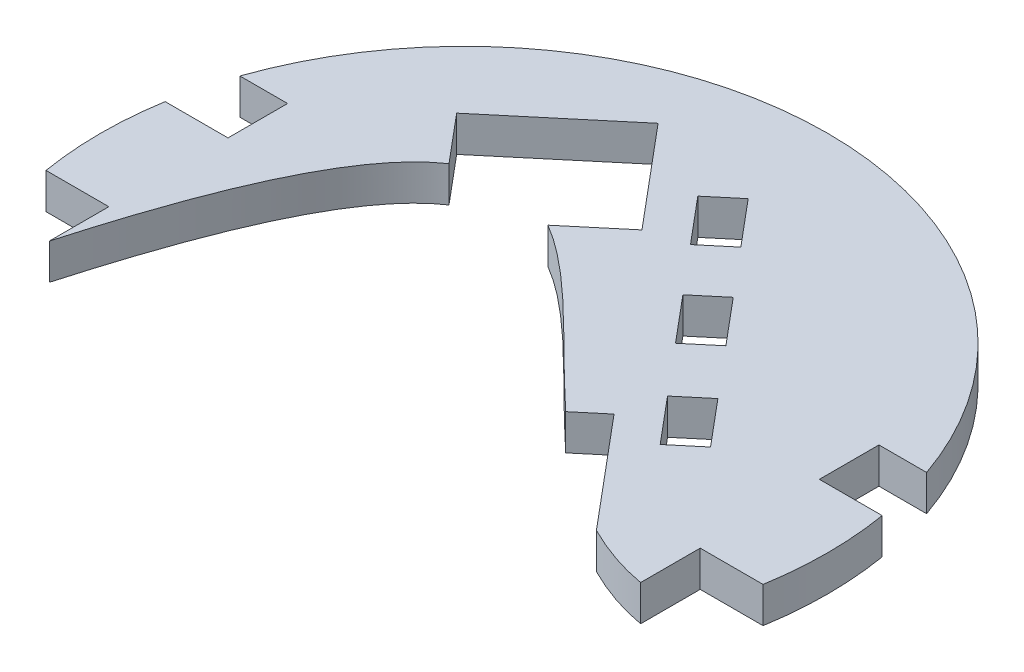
ISO-10303-21;
HEADER;
FILE_DESCRIPTION(('STEP AP214'),'2;1');
FILE_NAME('part.step','',(''),(''),'','','');
FILE_SCHEMA(('AUTOMOTIVE_DESIGN { 1 0 10303 214 1 1 1 1 }'));
ENDSEC;
DATA;
#1=APPLICATION_CONTEXT('core data for automotive mechanical design processes');
#2=APPLICATION_PROTOCOL_DEFINITION('international standard','automotive_design',2000,#1);
#3=PRODUCT_CONTEXT('',#1,'mechanical');
#4=PRODUCT('Part','Part','',(#3));
#5=PRODUCT_RELATED_PRODUCT_CATEGORY('part','',(#4));
#6=PRODUCT_DEFINITION_FORMATION('','',#4);
#7=PRODUCT_DEFINITION_CONTEXT('part definition',#1,'design');
#8=PRODUCT_DEFINITION('design','',#6,#7);
#9=PRODUCT_DEFINITION_SHAPE('','',#8);
#10=(LENGTH_UNIT() NAMED_UNIT(*) SI_UNIT(.MILLI.,.METRE.));
#11=(NAMED_UNIT(*) PLANE_ANGLE_UNIT() SI_UNIT($,.RADIAN.));
#12=(NAMED_UNIT(*) SI_UNIT($,.STERADIAN.) SOLID_ANGLE_UNIT());
#13=UNCERTAINTY_MEASURE_WITH_UNIT(LENGTH_MEASURE(1.E-05),#10,'distance_accuracy_value','');
#14=(GEOMETRIC_REPRESENTATION_CONTEXT(3) GLOBAL_UNCERTAINTY_ASSIGNED_CONTEXT((#13)) GLOBAL_UNIT_ASSIGNED_CONTEXT((#10,
#11,#12)) REPRESENTATION_CONTEXT('',''));
#15=CARTESIAN_POINT('',(0.,0.,0.));
#16=DIRECTION('',(0.,0.,1.));
#17=DIRECTION('',(1.,0.,0.));
#18=AXIS2_PLACEMENT_3D('',#15,#16,#17);
#19=CARTESIAN_POINT('',(0.,3.,0.));
#20=DIRECTION('',(0.,1.,0.));
#21=DIRECTION('',(0.,0.,1.));
#22=AXIS2_PLACEMENT_3D('',#19,#20,#21);
#23=PLANE('',#22);
#24=DIRECTION('',(0.64278760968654,0.,0.766044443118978));
#25=VECTOR('',#24,1.);
#26=CARTESIAN_POINT('',(11.8736888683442,3.,-9.96320795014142));
#27=LINE('',#26,#25);
#28=CARTESIAN_POINT('',(14.6858846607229,3.,-6.61176351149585));
#29=VERTEX_POINT('',#28);
#30=CARTESIAN_POINT('',(17.8998227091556,3.,-2.78154129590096));
#31=VERTEX_POINT('',#30);
#32=EDGE_CURVE('E721',#29,#31,#27,.T.);
#33=ORIENTED_EDGE('',*,*,#32,.T.);
#34=DIRECTION('',(-0.766044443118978,0.,0.64278760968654));
#35=VECTOR('',#34,1.);
#36=CARTESIAN_POINT('',(6.02613384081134,3.,7.18166665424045));
#37=LINE('',#36,#35);
#38=CARTESIAN_POINT('',(15.6016893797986,3.,-0.853178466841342));
#39=VERTEX_POINT('',#38);
#40=EDGE_CURVE('E724',#31,#39,#37,.T.);
#41=ORIENTED_EDGE('',*,*,#40,.T.);
#42=DIRECTION('',(0.64278760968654,0.,0.766044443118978));
#43=VECTOR('',#42,1.);
#44=CARTESIAN_POINT('',(9.57555553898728,3.,-8.0348451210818));
#45=LINE('',#44,#43);
#46=CARTESIAN_POINT('',(12.3877513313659,3.,-4.68340068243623));
#47=VERTEX_POINT('',#46);
#48=EDGE_CURVE('E711',#47,#39,#45,.T.);
#49=ORIENTED_EDGE('',*,*,#48,.F.);
#50=DIRECTION('',(-0.766044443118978,0.,0.64278760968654));
#51=VECTOR('',#50,1.);
#52=CARTESIAN_POINT('',(2.81219579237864,3.,3.35144443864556));
#53=LINE('',#52,#51);
#54=EDGE_CURVE('E718',#29,#47,#53,.T.);
#55=ORIENTED_EDGE('',*,*,#54,.F.);
#56=EDGE_LOOP('',(#33,#41,#49,#55));
#57=FACE_BOUND('',#56,.T.);
#58=DIRECTION('',(0.64278760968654,0.,0.766044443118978));
#59=VECTOR('',#58,1.);
#60=CARTESIAN_POINT('',(11.8736888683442,3.,-9.96320795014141));
#61=LINE('',#60,#59);
#62=CARTESIAN_POINT('',(1.42839021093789,3.,-22.4114301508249));
#63=VERTEX_POINT('',#62);
#64=CARTESIAN_POINT('',(4.64232825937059,3.,-18.58120793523));
#65=VERTEX_POINT('',#64);
#66=EDGE_CURVE('E700',#63,#65,#61,.T.);
#67=ORIENTED_EDGE('',*,*,#66,.T.);
#68=DIRECTION('',(-0.766044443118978,0.,0.64278760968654));
#69=VECTOR('',#68,1.);
#70=CARTESIAN_POINT('',(-7.23136060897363,3.,-8.61799998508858));
#71=LINE('',#70,#69);
#72=CARTESIAN_POINT('',(2.34419493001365,3.,-16.6528451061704));
#73=VERTEX_POINT('',#72);
#74=EDGE_CURVE('E703',#65,#73,#71,.T.);
#75=ORIENTED_EDGE('',*,*,#74,.T.);
#76=DIRECTION('',(0.64278760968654,0.,0.766044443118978));
#77=VECTOR('',#76,1.);
#78=CARTESIAN_POINT('',(9.57555553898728,3.,-8.0348451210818));
#79=LINE('',#78,#77);
#80=CARTESIAN_POINT('',(-0.869743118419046,3.,-20.4830673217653));
#81=VERTEX_POINT('',#80);
#82=EDGE_CURVE('E690',#81,#73,#79,.T.);
#83=ORIENTED_EDGE('',*,*,#82,.F.);
#84=DIRECTION('',(-0.766044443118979,0.,0.642787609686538));
#85=VECTOR('',#84,1.);
#86=CARTESIAN_POINT('',(-10.4452986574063,3.,-12.4482222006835));
#87=LINE('',#86,#85);
#88=EDGE_CURVE('E697',#63,#81,#87,.T.);
#89=ORIENTED_EDGE('',*,*,#88,.F.);
#90=EDGE_LOOP('',(#67,#75,#83,#89));
#91=FACE_BOUND('',#90,.T.);
#92=CARTESIAN_POINT('',(24.8140590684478,3.,10.));
#93=CARTESIAN_POINT('',(2.6081002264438,3.,6.09954088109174));
#94=CARTESIAN_POINT('',(-10.3265066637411,3.,-41.1093024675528));
#95=CARTESIAN_POINT('',(-24.8140590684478,3.,10.));
#96=B_SPLINE_CURVE_WITH_KNOTS('',3,(#92,#93,#94,#95),.UNSPECIFIED.,.F.,.F.,(4,4),(0.,1.),.UNSPECIFIED.);
#97=CARTESIAN_POINT('',(-13.6660144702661,3.,-12.3972122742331));
#98=VERTEX_POINT('',#97);
#99=CARTESIAN_POINT('',(-24.8140590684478,3.,10.));
#100=VERTEX_POINT('',#99);
#101=EDGE_CURVE('E405',#98,#100,#96,.T.);
#102=ORIENTED_EDGE('',*,*,#101,.F.);
#103=DIRECTION('',(-0.64278760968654,0.,-0.766044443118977));
#104=VECTOR('',#103,1.);
#105=CARTESIAN_POINT('',(-1.91511110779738,3.,1.6069690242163));
#106=LINE('',#105,#104);
#107=CARTESIAN_POINT('',(-17.0206199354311,3.,-16.3950753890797));
#108=VERTEX_POINT('',#107);
#109=EDGE_CURVE('E750',#98,#108,#106,.T.);
#110=ORIENTED_EDGE('',*,*,#109,.T.);
#111=DIRECTION('',(-0.766044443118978,0.,0.64278760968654));
#112=VECTOR('',#111,1.);
#113=CARTESIAN_POINT('',(-15.1055088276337,3.,-18.002044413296));
#114=LINE('',#113,#112);
#115=CARTESIAN_POINT('',(-7.82808661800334,3.,-24.1085267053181));
#116=VERTEX_POINT('',#115);
#117=EDGE_CURVE('E765',#116,#108,#114,.T.);
#118=ORIENTED_EDGE('',*,*,#117,.F.);
#119=DIRECTION('',(0.642787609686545,0.,0.766044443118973));
#120=VECTOR('',#119,1.);
#121=CARTESIAN_POINT('',(7.27742220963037,3.,-6.10648229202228));
#122=LINE('',#121,#120);
#123=CARTESIAN_POINT('',(-0.757422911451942,3.,-15.6820378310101));
#124=VERTEX_POINT('',#123);
#125=EDGE_CURVE('E768',#116,#124,#122,.T.);
#126=ORIENTED_EDGE('',*,*,#125,.T.);
#127=DIRECTION('',(-0.766044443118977,0.,0.64278760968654));
#128=VECTOR('',#127,1.);
#129=CARTESIAN_POINT('',(-8.0348451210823,3.,-9.57555553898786));
#130=LINE('',#129,#128);
#131=CARTESIAN_POINT('',(-5.04935939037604,3.,-12.0806755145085));
#132=VERTEX_POINT('',#131);
#133=EDGE_CURVE('E771',#124,#132,#130,.T.);
#134=ORIENTED_EDGE('',*,*,#133,.T.);
#135=CARTESIAN_POINT('',(9.24867851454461,3.,0.724584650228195));
#136=VERTEX_POINT('',#135);
#137=EDGE_CURVE('E774',#136,#132,#96,.T.);
#138=ORIENTED_EDGE('',*,*,#137,.F.);
#139=DIRECTION('',(-0.766044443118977,0.,0.64278760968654));
#140=VECTOR('',#139,1.);
#141=CARTESIAN_POINT('',(4.17811946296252,3.,4.97928888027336));
#142=LINE('',#141,#140);
#143=CARTESIAN_POINT('',(11.4555416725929,3.,-1.12719341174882));
#144=VERTEX_POINT('',#143);
#145=EDGE_CURVE('E775',#144,#136,#142,.T.);
#146=ORIENTED_EDGE('',*,*,#145,.F.);
#147=DIRECTION('',(0.64278760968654,0.,0.766044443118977));
#148=VECTOR('',#147,1.);
#149=CARTESIAN_POINT('',(7.27742220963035,3.,-6.10648229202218));
#150=LINE('',#149,#148);
#151=CARTESIAN_POINT('',(19.1689929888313,3.,8.0653399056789));
#152=VERTEX_POINT('',#151);
#153=EDGE_CURVE('E777',#144,#152,#150,.T.);
#154=ORIENTED_EDGE('',*,*,#153,.T.);
#155=CARTESIAN_POINT('',(24.8140590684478,3.,10.));
#156=VERTEX_POINT('',#155);
#157=EDGE_CURVE('E779',#156,#152,#96,.T.);
#158=ORIENTED_EDGE('',*,*,#157,.F.);
#159=DIRECTION('',(0.,0.,1.));
#160=VECTOR('',#159,1.);
#161=CARTESIAN_POINT('',(24.8140590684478,3.,0.));
#162=LINE('',#161,#160);
#163=CARTESIAN_POINT('',(24.8140590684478,3.,5.));
#164=VERTEX_POINT('',#163);
#165=EDGE_CURVE('E682',#164,#156,#162,.T.);
#166=ORIENTED_EDGE('',*,*,#165,.F.);
#167=DIRECTION('',(1.,0.,0.));
#168=VECTOR('',#167,1.);
#169=CARTESIAN_POINT('',(0.,3.,5.));
#170=LINE('',#169,#168);
#171=CARTESIAN_POINT('',(30.0873727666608,3.,5.));
#172=VERTEX_POINT('',#171);
#173=EDGE_CURVE('E571',#164,#172,#170,.T.);
#174=ORIENTED_EDGE('',*,*,#173,.T.);
#175=CARTESIAN_POINT('',(0.,3.,0.));
#176=DIRECTION('',(0.,1.,0.));
#177=DIRECTION('',(0.,0.,1.));
#178=AXIS2_PLACEMENT_3D('',#175,#176,#177);
#179=CIRCLE('',#178,30.5);
#180=CARTESIAN_POINT('',(30.0873727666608,3.,-5.));
#181=VERTEX_POINT('',#180);
#182=EDGE_CURVE('E551',#172,#181,#179,.T.);
#183=ORIENTED_EDGE('',*,*,#182,.T.);
#184=DIRECTION('',(1.,0.,0.));
#185=VECTOR('',#184,1.);
#186=CARTESIAN_POINT('',(0.,3.,-5.00000000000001));
#187=LINE('',#186,#185);
#188=CARTESIAN_POINT('',(24.8140590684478,3.,-5.));
#189=VERTEX_POINT('',#188);
#190=EDGE_CURVE('E667',#189,#181,#187,.T.);
#191=ORIENTED_EDGE('',*,*,#190,.F.);
#192=DIRECTION('',(0.,0.,-1.));
#193=VECTOR('',#192,1.);
#194=CARTESIAN_POINT('',(24.8140590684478,3.,0.));
#195=LINE('',#194,#193);
#196=CARTESIAN_POINT('',(24.8140590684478,3.,-10.));
#197=VERTEX_POINT('',#196);
#198=EDGE_CURVE('E671',#189,#197,#195,.T.);
#199=ORIENTED_EDGE('',*,*,#198,.T.);
#200=DIRECTION('',(1.,0.,0.));
#201=VECTOR('',#200,1.);
#202=CARTESIAN_POINT('',(0.,3.,-10.));
#203=LINE('',#202,#201);
#204=CARTESIAN_POINT('',(28.8140590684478,3.,-10.));
#205=VERTEX_POINT('',#204);
#206=EDGE_CURVE('E674',#197,#205,#203,.T.);
#207=ORIENTED_EDGE('',*,*,#206,.T.);
#208=CARTESIAN_POINT('',(-28.8140590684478,3.,-10.));
#209=VERTEX_POINT('',#208);
#210=EDGE_CURVE('E631',#205,#209,#179,.T.);
#211=ORIENTED_EDGE('',*,*,#210,.T.);
#212=DIRECTION('',(-1.,0.,0.));
#213=VECTOR('',#212,1.);
#214=CARTESIAN_POINT('',(0.,3.,-10.));
#215=LINE('',#214,#213);
#216=CARTESIAN_POINT('',(-24.8140590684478,3.,-10.));
#217=VERTEX_POINT('',#216);
#218=EDGE_CURVE('E645',#217,#209,#215,.T.);
#219=ORIENTED_EDGE('',*,*,#218,.F.);
#220=DIRECTION('',(0.,0.,-1.));
#221=VECTOR('',#220,1.);
#222=CARTESIAN_POINT('',(-24.8140590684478,3.,0.));
#223=LINE('',#222,#221);
#224=CARTESIAN_POINT('',(-24.8140590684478,3.,-5.));
#225=VERTEX_POINT('',#224);
#226=EDGE_CURVE('E653',#225,#217,#223,.T.);
#227=ORIENTED_EDGE('',*,*,#226,.F.);
#228=DIRECTION('',(-1.,0.,0.));
#229=VECTOR('',#228,1.);
#230=CARTESIAN_POINT('',(0.,3.,-5.));
#231=LINE('',#230,#229);
#232=CARTESIAN_POINT('',(-30.0873727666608,3.,-5.));
#233=VERTEX_POINT('',#232);
#234=EDGE_CURVE('E656',#225,#233,#231,.T.);
#235=ORIENTED_EDGE('',*,*,#234,.T.);
#236=CARTESIAN_POINT('',(-30.0873727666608,3.,5.));
#237=VERTEX_POINT('',#236);
#238=EDGE_CURVE('E627',#233,#237,#179,.T.);
#239=ORIENTED_EDGE('',*,*,#238,.T.);
#240=DIRECTION('',(-1.,0.,0.));
#241=VECTOR('',#240,1.);
#242=CARTESIAN_POINT('',(0.,3.,5.00000000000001));
#243=LINE('',#242,#241);
#244=CARTESIAN_POINT('',(-24.8140590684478,3.,5.));
#245=VERTEX_POINT('',#244);
#246=EDGE_CURVE('E638',#245,#237,#243,.T.);
#247=ORIENTED_EDGE('',*,*,#246,.F.);
#248=DIRECTION('',(0.,0.,1.));
#249=VECTOR('',#248,1.);
#250=CARTESIAN_POINT('',(-24.8140590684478,3.,0.));
#251=LINE('',#250,#249);
#252=EDGE_CURVE('E634',#245,#100,#251,.T.);
#253=ORIENTED_EDGE('',*,*,#252,.T.);
#254=EDGE_LOOP('',(#102,#110,#118,#126,#134,#138,#146,#154,#158,#166,#174,#183,#191,#199,#207,
#211,#219,#227,#235,#239,#247,#253));
#255=FACE_BOUND('',#254,.T.);
#256=DIRECTION('',(-0.766044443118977,0.,0.642787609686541));
#257=VECTOR('',#256,1.);
#258=CARTESIAN_POINT('',(-3.90227068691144,3.,-4.65054511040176));
#259=LINE('',#258,#257);
#260=CARTESIAN_POINT('',(7.97141818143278,3.,-14.6137530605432));
#261=VERTEX_POINT('',#260);
#262=CARTESIAN_POINT('',(5.67328485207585,3.,-12.6853902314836));
#263=VERTEX_POINT('',#262);
#264=EDGE_CURVE('E393',#261,#263,#259,.T.);
#265=ORIENTED_EDGE('',*,*,#264,.F.);
#266=DIRECTION('',(0.642787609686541,0.,0.766044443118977));
#267=VECTOR('',#266,1.);
#268=CARTESIAN_POINT('',(11.8736888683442,3.,-9.96320795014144));
#269=LINE('',#268,#267);
#270=CARTESIAN_POINT('',(11.1853562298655,3.,-10.7835308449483));
#271=VERTEX_POINT('',#270);
#272=EDGE_CURVE('E176',#261,#271,#269,.T.);
#273=ORIENTED_EDGE('',*,*,#272,.T.);
#274=DIRECTION('',(-0.766044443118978,0.,0.64278760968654));
#275=VECTOR('',#274,1.);
#276=CARTESIAN_POINT('',(-0.688332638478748,3.,-0.820322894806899));
#277=LINE('',#276,#275);
#278=CARTESIAN_POINT('',(8.88722290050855,3.,-8.8551680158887));
#279=VERTEX_POINT('',#278);
#280=EDGE_CURVE('E398',#271,#279,#277,.T.);
#281=ORIENTED_EDGE('',*,*,#280,.T.);
#282=DIRECTION('',(0.64278760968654,0.,0.766044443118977));
#283=VECTOR('',#282,1.);
#284=CARTESIAN_POINT('',(9.57555553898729,3.,-8.03484512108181));
#285=LINE('',#284,#283);
#286=EDGE_CURVE('E384',#263,#279,#285,.T.);
#287=ORIENTED_EDGE('',*,*,#286,.F.);
#288=EDGE_LOOP('',(#265,#273,#281,#287));
#289=FACE_BOUND('',#288,.T.);
#290=ADVANCED_FACE('F161',(#57,#91,#255,#289),#23,.T.);
#291=CARTESIAN_POINT('',(0.,0.,0.));
#292=DIRECTION('',(0.,1.,0.));
#293=DIRECTION('',(0.,0.,1.));
#294=AXIS2_PLACEMENT_3D('',#291,#292,#293);
#295=PLANE('',#294);
#296=DIRECTION('',(-0.766044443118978,0.,0.64278760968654));
#297=VECTOR('',#296,1.);
#298=CARTESIAN_POINT('',(6.02613384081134,0.,7.18166665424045));
#299=LINE('',#298,#297);
#300=CARTESIAN_POINT('',(17.8998227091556,0.,-2.78154129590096));
#301=VERTEX_POINT('',#300);
#302=CARTESIAN_POINT('',(15.6016893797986,0.,-0.853178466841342));
#303=VERTEX_POINT('',#302);
#304=EDGE_CURVE('E524',#301,#303,#299,.T.);
#305=ORIENTED_EDGE('',*,*,#304,.F.);
#306=DIRECTION('',(0.64278760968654,0.,0.766044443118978));
#307=VECTOR('',#306,1.);
#308=CARTESIAN_POINT('',(11.8736888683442,0.,-9.96320795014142));
#309=LINE('',#308,#307);
#310=CARTESIAN_POINT('',(14.6858846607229,0.,-6.61176351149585));
#311=VERTEX_POINT('',#310);
#312=EDGE_CURVE('E598',#311,#301,#309,.T.);
#313=ORIENTED_EDGE('',*,*,#312,.F.);
#314=DIRECTION('',(-0.766044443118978,0.,0.64278760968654));
#315=VECTOR('',#314,1.);
#316=CARTESIAN_POINT('',(2.81219579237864,0.,3.35144443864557));
#317=LINE('',#316,#315);
#318=CARTESIAN_POINT('',(12.3877513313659,0.,-4.68340068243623));
#319=VERTEX_POINT('',#318);
#320=EDGE_CURVE('E595',#311,#319,#317,.T.);
#321=ORIENTED_EDGE('',*,*,#320,.T.);
#322=DIRECTION('',(0.64278760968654,0.,0.766044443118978));
#323=VECTOR('',#322,1.);
#324=CARTESIAN_POINT('',(9.57555553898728,0.,-8.0348451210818));
#325=LINE('',#324,#323);
#326=EDGE_CURVE('E593',#319,#303,#325,.T.);
#327=ORIENTED_EDGE('',*,*,#326,.T.);
#328=EDGE_LOOP('',(#305,#313,#321,#327));
#329=FACE_BOUND('',#328,.T.);
#330=DIRECTION('',(-0.64278760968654,0.,-0.766044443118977));
#331=VECTOR('',#330,1.);
#332=CARTESIAN_POINT('',(-1.91511110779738,0.,1.6069690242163));
#333=LINE('',#332,#331);
#334=CARTESIAN_POINT('',(-13.6660144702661,0.,-12.3972122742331));
#335=VERTEX_POINT('',#334);
#336=CARTESIAN_POINT('',(-17.0206199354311,0.,-16.3950753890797));
#337=VERTEX_POINT('',#336);
#338=EDGE_CURVE('E529',#335,#337,#333,.T.);
#339=ORIENTED_EDGE('',*,*,#338,.F.);
#340=CARTESIAN_POINT('',(24.8140590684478,0.,10.));
#341=CARTESIAN_POINT('',(2.6081002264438,0.,6.09954088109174));
#342=CARTESIAN_POINT('',(-10.3265066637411,0.,-41.1093024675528));
#343=CARTESIAN_POINT('',(-24.8140590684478,0.,10.));
#344=B_SPLINE_CURVE_WITH_KNOTS('',3,(#340,#341,#342,#343),.UNSPECIFIED.,.F.,.F.,(4,4),(0.,1.),.UNSPECIFIED.);
#345=CARTESIAN_POINT('',(-24.8140590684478,0.,10.));
#346=VERTEX_POINT('',#345);
#347=EDGE_CURVE('E727',#335,#346,#344,.T.);
#348=ORIENTED_EDGE('',*,*,#347,.T.);
#349=DIRECTION('',(0.,0.,1.));
#350=VECTOR('',#349,1.);
#351=CARTESIAN_POINT('',(-24.8140590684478,0.,0.));
#352=LINE('',#351,#350);
#353=CARTESIAN_POINT('',(-24.8140590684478,0.,5.));
#354=VERTEX_POINT('',#353);
#355=EDGE_CURVE('E547',#354,#346,#352,.T.);
#356=ORIENTED_EDGE('',*,*,#355,.F.);
#357=DIRECTION('',(-1.,0.,0.));
#358=VECTOR('',#357,1.);
#359=CARTESIAN_POINT('',(0.,0.,5.00000000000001));
#360=LINE('',#359,#358);
#361=CARTESIAN_POINT('',(-30.0873727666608,0.,5.));
#362=VERTEX_POINT('',#361);
#363=EDGE_CURVE('E550',#354,#362,#360,.T.);
#364=ORIENTED_EDGE('',*,*,#363,.T.);
#365=CARTESIAN_POINT('',(0.,0.,0.));
#366=DIRECTION('',(0.,1.,0.));
#367=DIRECTION('',(0.,0.,1.));
#368=AXIS2_PLACEMENT_3D('',#365,#366,#367);
#369=CIRCLE('',#368,30.5);
#370=CARTESIAN_POINT('',(-30.0873727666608,0.,-5.));
#371=VERTEX_POINT('',#370);
#372=EDGE_CURVE('E629',#371,#362,#369,.T.);
#373=ORIENTED_EDGE('',*,*,#372,.F.);
#374=DIRECTION('',(-1.,0.,0.));
#375=VECTOR('',#374,1.);
#376=CARTESIAN_POINT('',(0.,0.,-5.));
#377=LINE('',#376,#375);
#378=CARTESIAN_POINT('',(-24.8140590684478,0.,-5.));
#379=VERTEX_POINT('',#378);
#380=EDGE_CURVE('E615',#379,#371,#377,.T.);
#381=ORIENTED_EDGE('',*,*,#380,.F.);
#382=DIRECTION('',(0.,0.,-1.));
#383=VECTOR('',#382,1.);
#384=CARTESIAN_POINT('',(-24.8140590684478,0.,0.));
#385=LINE('',#384,#383);
#386=CARTESIAN_POINT('',(-24.8140590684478,0.,-10.));
#387=VERTEX_POINT('',#386);
#388=EDGE_CURVE('E620',#379,#387,#385,.T.);
#389=ORIENTED_EDGE('',*,*,#388,.T.);
#390=DIRECTION('',(-1.,0.,0.));
#391=VECTOR('',#390,1.);
#392=CARTESIAN_POINT('',(0.,0.,-10.));
#393=LINE('',#392,#391);
#394=CARTESIAN_POINT('',(-28.8140590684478,0.,-10.));
#395=VERTEX_POINT('',#394);
#396=EDGE_CURVE('E617',#387,#395,#393,.T.);
#397=ORIENTED_EDGE('',*,*,#396,.T.);
#398=CARTESIAN_POINT('',(28.8140590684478,0.,-10.));
#399=VERTEX_POINT('',#398);
#400=EDGE_CURVE('E628',#399,#395,#369,.T.);
#401=ORIENTED_EDGE('',*,*,#400,.F.);
#402=DIRECTION('',(1.,0.,0.));
#403=VECTOR('',#402,1.);
#404=CARTESIAN_POINT('',(0.,0.,-10.));
#405=LINE('',#404,#403);
#406=CARTESIAN_POINT('',(24.8140590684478,0.,-10.));
#407=VERTEX_POINT('',#406);
#408=EDGE_CURVE('E659',#407,#399,#405,.T.);
#409=ORIENTED_EDGE('',*,*,#408,.F.);
#410=DIRECTION('',(0.,0.,-1.));
#411=VECTOR('',#410,1.);
#412=CARTESIAN_POINT('',(24.8140590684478,0.,0.));
#413=LINE('',#412,#411);
#414=CARTESIAN_POINT('',(24.8140590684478,0.,-5.));
#415=VERTEX_POINT('',#414);
#416=EDGE_CURVE('E608',#415,#407,#413,.T.);
#417=ORIENTED_EDGE('',*,*,#416,.F.);
#418=DIRECTION('',(1.,0.,0.));
#419=VECTOR('',#418,1.);
#420=CARTESIAN_POINT('',(0.,0.,-5.00000000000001));
#421=LINE('',#420,#419);
#422=CARTESIAN_POINT('',(30.0873727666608,0.,-5.));
#423=VERTEX_POINT('',#422);
#424=EDGE_CURVE('E661',#415,#423,#421,.T.);
#425=ORIENTED_EDGE('',*,*,#424,.T.);
#426=CARTESIAN_POINT('',(30.0873727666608,0.,5.));
#427=VERTEX_POINT('',#426);
#428=EDGE_CURVE('E625',#427,#423,#369,.T.);
#429=ORIENTED_EDGE('',*,*,#428,.F.);
#430=DIRECTION('',(1.,0.,0.));
#431=VECTOR('',#430,1.);
#432=CARTESIAN_POINT('',(0.,0.,5.));
#433=LINE('',#432,#431);
#434=CARTESIAN_POINT('',(24.8140590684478,0.,5.));
#435=VERTEX_POINT('',#434);
#436=EDGE_CURVE('E677',#435,#427,#433,.T.);
#437=ORIENTED_EDGE('',*,*,#436,.F.);
#438=DIRECTION('',(0.,0.,1.));
#439=VECTOR('',#438,1.);
#440=CARTESIAN_POINT('',(24.8140590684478,0.,0.));
#441=LINE('',#440,#439);
#442=CARTESIAN_POINT('',(24.8140590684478,0.,10.));
#443=VERTEX_POINT('',#442);
#444=EDGE_CURVE('E561',#435,#443,#441,.T.);
#445=ORIENTED_EDGE('',*,*,#444,.T.);
#446=CARTESIAN_POINT('',(24.8140590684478,0.,10.));
#447=CARTESIAN_POINT('',(2.6081002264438,0.,6.09954088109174));
#448=CARTESIAN_POINT('',(-10.3265066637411,0.,-41.1093024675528));
#449=CARTESIAN_POINT('',(-24.8140590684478,0.,10.));
#450=B_SPLINE_CURVE_WITH_KNOTS('',3,(#446,#447,#448,#449),.UNSPECIFIED.,.F.,.F.,(4,4),(0.,1.),.UNSPECIFIED.);
#451=CARTESIAN_POINT('',(19.1689929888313,0.,8.0653399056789));
#452=VERTEX_POINT('',#451);
#453=EDGE_CURVE('E736',#443,#452,#450,.T.);
#454=ORIENTED_EDGE('',*,*,#453,.T.);
#455=DIRECTION('',(0.64278760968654,0.,0.766044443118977));
#456=VECTOR('',#455,1.);
#457=CARTESIAN_POINT('',(7.27742220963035,0.,-6.10648229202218));
#458=LINE('',#457,#456);
#459=CARTESIAN_POINT('',(11.4555416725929,0.,-1.12719341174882));
#460=VERTEX_POINT('',#459);
#461=EDGE_CURVE('E590',#460,#452,#458,.T.);
#462=ORIENTED_EDGE('',*,*,#461,.F.);
#463=DIRECTION('',(-0.766044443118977,0.,0.642787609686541));
#464=VECTOR('',#463,1.);
#465=CARTESIAN_POINT('',(4.17811946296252,0.,4.97928888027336));
#466=LINE('',#465,#464);
#467=CARTESIAN_POINT('',(9.24867851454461,0.,0.724584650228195));
#468=VERTEX_POINT('',#467);
#469=EDGE_CURVE('E584',#460,#468,#466,.T.);
#470=ORIENTED_EDGE('',*,*,#469,.T.);
#471=CARTESIAN_POINT('',(24.8140590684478,0.,10.));
#472=CARTESIAN_POINT('',(2.6081002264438,0.,6.09954088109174));
#473=CARTESIAN_POINT('',(-10.3265066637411,0.,-41.1093024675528));
#474=CARTESIAN_POINT('',(-24.8140590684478,0.,10.));
#475=B_SPLINE_CURVE_WITH_KNOTS('',3,(#471,#472,#473,#474),.UNSPECIFIED.,.F.,.F.,(4,4),(0.,1.),.UNSPECIFIED.);
#476=CARTESIAN_POINT('',(-5.04935939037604,0.,-12.0806755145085));
#477=VERTEX_POINT('',#476);
#478=EDGE_CURVE('E579',#468,#477,#475,.T.);
#479=ORIENTED_EDGE('',*,*,#478,.T.);
#480=DIRECTION('',(-0.766044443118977,0.,0.64278760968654));
#481=VECTOR('',#480,1.);
#482=CARTESIAN_POINT('',(-8.0348451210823,0.,-9.57555553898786));
#483=LINE('',#482,#481);
#484=CARTESIAN_POINT('',(-0.757422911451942,0.,-15.6820378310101));
#485=VERTEX_POINT('',#484);
#486=EDGE_CURVE('E577',#485,#477,#483,.T.);
#487=ORIENTED_EDGE('',*,*,#486,.F.);
#488=DIRECTION('',(0.642787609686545,0.,0.766044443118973));
#489=VECTOR('',#488,1.);
#490=CARTESIAN_POINT('',(7.27742220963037,0.,-6.10648229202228));
#491=LINE('',#490,#489);
#492=CARTESIAN_POINT('',(-7.82808661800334,0.,-24.1085267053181));
#493=VERTEX_POINT('',#492);
#494=EDGE_CURVE('E575',#493,#485,#491,.T.);
#495=ORIENTED_EDGE('',*,*,#494,.F.);
#496=DIRECTION('',(-0.766044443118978,0.,0.64278760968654));
#497=VECTOR('',#496,1.);
#498=CARTESIAN_POINT('',(-15.1055088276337,0.,-18.002044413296));
#499=LINE('',#498,#497);
#500=EDGE_CURVE('E573',#493,#337,#499,.T.);
#501=ORIENTED_EDGE('',*,*,#500,.T.);
#502=EDGE_LOOP('',(#339,#348,#356,#364,#373,#381,#389,#397,#401,#409,#417,#425,#429,#437,#445,
#454,#462,#470,#479,#487,#495,#501));
#503=FACE_BOUND('',#502,.T.);
#504=DIRECTION('',(-0.766044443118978,0.,0.64278760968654));
#505=VECTOR('',#504,1.);
#506=CARTESIAN_POINT('',(-7.23136060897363,0.,-8.61799998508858));
#507=LINE('',#506,#505);
#508=CARTESIAN_POINT('',(4.64232825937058,0.,-18.58120793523));
#509=VERTEX_POINT('',#508);
#510=CARTESIAN_POINT('',(2.34419493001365,0.,-16.6528451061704));
#511=VERTEX_POINT('',#510);
#512=EDGE_CURVE('E534',#509,#511,#507,.T.);
#513=ORIENTED_EDGE('',*,*,#512,.F.);
#514=DIRECTION('',(0.64278760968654,0.,0.766044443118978));
#515=VECTOR('',#514,1.);
#516=CARTESIAN_POINT('',(11.8736888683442,0.,-9.96320795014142));
#517=LINE('',#516,#515);
#518=CARTESIAN_POINT('',(1.4283902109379,0.,-22.4114301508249));
#519=VERTEX_POINT('',#518);
#520=EDGE_CURVE('E564',#519,#509,#517,.T.);
#521=ORIENTED_EDGE('',*,*,#520,.F.);
#522=DIRECTION('',(-0.766044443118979,0.,0.642787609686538));
#523=VECTOR('',#522,1.);
#524=CARTESIAN_POINT('',(-10.4452986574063,0.,-12.4482222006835));
#525=LINE('',#524,#523);
#526=CARTESIAN_POINT('',(-0.869743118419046,0.,-20.4830673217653));
#527=VERTEX_POINT('',#526);
#528=EDGE_CURVE('E603',#519,#527,#525,.T.);
#529=ORIENTED_EDGE('',*,*,#528,.T.);
#530=DIRECTION('',(0.64278760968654,0.,0.766044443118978));
#531=VECTOR('',#530,1.);
#532=CARTESIAN_POINT('',(9.57555553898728,0.,-8.0348451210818));
#533=LINE('',#532,#531);
#534=EDGE_CURVE('E601',#527,#511,#533,.T.);
#535=ORIENTED_EDGE('',*,*,#534,.T.);
#536=EDGE_LOOP('',(#513,#521,#529,#535));
#537=FACE_BOUND('',#536,.T.);
#538=DIRECTION('',(0.642787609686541,0.,0.766044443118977));
#539=VECTOR('',#538,1.);
#540=CARTESIAN_POINT('',(11.8736888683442,0.,-9.96320795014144));
#541=LINE('',#540,#539);
#542=CARTESIAN_POINT('',(7.97141818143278,0.,-14.6137530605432));
#543=VERTEX_POINT('',#542);
#544=CARTESIAN_POINT('',(11.1853562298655,0.,-10.7835308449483));
#545=VERTEX_POINT('',#544);
#546=EDGE_CURVE('E12',#543,#545,#541,.T.);
#547=ORIENTED_EDGE('',*,*,#546,.F.);
#548=DIRECTION('',(-0.766044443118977,0.,0.642787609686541));
#549=VECTOR('',#548,1.);
#550=CARTESIAN_POINT('',(-3.90227068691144,0.,-4.65054511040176));
#551=LINE('',#550,#549);
#552=CARTESIAN_POINT('',(5.67328485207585,0.,-12.6853902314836));
#553=VERTEX_POINT('',#552);
#554=EDGE_CURVE('E537',#543,#553,#551,.T.);
#555=ORIENTED_EDGE('',*,*,#554,.T.);
#556=DIRECTION('',(0.64278760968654,0.,0.766044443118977));
#557=VECTOR('',#556,1.);
#558=CARTESIAN_POINT('',(9.57555553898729,0.,-8.03484512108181));
#559=LINE('',#558,#557);
#560=CARTESIAN_POINT('',(8.88722290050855,0.,-8.8551680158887));
#561=VERTEX_POINT('',#560);
#562=EDGE_CURVE('E387',#553,#561,#559,.T.);
#563=ORIENTED_EDGE('',*,*,#562,.T.);
#564=DIRECTION('',(-0.766044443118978,0.,0.64278760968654));
#565=VECTOR('',#564,1.);
#566=CARTESIAN_POINT('',(-0.688332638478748,0.,-0.820322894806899));
#567=LINE('',#566,#565);
#568=EDGE_CURVE('E169',#545,#561,#567,.T.);
#569=ORIENTED_EDGE('',*,*,#568,.F.);
#570=EDGE_LOOP('',(#547,#555,#563,#569));
#571=FACE_BOUND('',#570,.T.);
#572=ADVANCED_FACE('F511',(#329,#503,#537,#571),#295,.F.);
#573=CARTESIAN_POINT('',(0.,3.,0.));
#574=DIRECTION('',(0.,-1.,0.));
#575=DIRECTION('',(0.,0.,-1.));
#576=AXIS2_PLACEMENT_3D('',#573,#574,#575);
#577=CYLINDRICAL_SURFACE('',#576,30.5);
#578=DIRECTION('',(0.,-1.,0.));
#579=VECTOR('',#578,1.);
#580=CARTESIAN_POINT('',(30.0873727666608,3.,5.));
#581=LINE('',#580,#579);
#582=EDGE_CURVE('E565',#427,#172,#581,.F.);
#583=ORIENTED_EDGE('',*,*,#582,.F.);
#584=ORIENTED_EDGE('',*,*,#428,.T.);
#585=DIRECTION('',(0.,-1.,0.));
#586=VECTOR('',#585,1.);
#587=CARTESIAN_POINT('',(30.0873727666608,3.,-5.));
#588=LINE('',#587,#586);
#589=EDGE_CURVE('E612',#423,#181,#588,.F.);
#590=ORIENTED_EDGE('',*,*,#589,.T.);
#591=ORIENTED_EDGE('',*,*,#182,.F.);
#592=EDGE_LOOP('',(#583,#584,#590,#591));
#593=FACE_BOUND('',#592,.T.);
#594=ADVANCED_FACE('F163',(#593),#577,.T.);
#595=DIRECTION('',(0.,-1.,0.));
#596=VECTOR('',#595,1.);
#597=CARTESIAN_POINT('',(28.8140590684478,3.,-10.));
#598=LINE('',#597,#596);
#599=EDGE_CURVE('E610',#399,#205,#598,.F.);
#600=ORIENTED_EDGE('',*,*,#599,.F.);
#601=ORIENTED_EDGE('',*,*,#400,.T.);
#602=DIRECTION('',(0.,1.,0.));
#603=VECTOR('',#602,1.);
#604=CARTESIAN_POINT('',(-28.8140590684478,-1.,-10.));
#605=LINE('',#604,#603);
#606=EDGE_CURVE('E647',#395,#209,#605,.T.);
#607=ORIENTED_EDGE('',*,*,#606,.T.);
#608=ORIENTED_EDGE('',*,*,#210,.F.);
#609=EDGE_LOOP('',(#600,#601,#607,#608));
#610=FACE_BOUND('',#609,.T.);
#611=ADVANCED_FACE('F518',(#610),#577,.T.);
#612=DIRECTION('',(0.,1.,0.));
#613=VECTOR('',#612,1.);
#614=CARTESIAN_POINT('',(-30.0873727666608,-1.,-5.));
#615=LINE('',#614,#613);
#616=EDGE_CURVE('E641',#371,#233,#615,.T.);
#617=ORIENTED_EDGE('',*,*,#616,.F.);
#618=ORIENTED_EDGE('',*,*,#372,.T.);
#619=DIRECTION('',(0.,1.,0.));
#620=VECTOR('',#619,1.);
#621=CARTESIAN_POINT('',(-30.0873727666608,-1.,5.));
#622=LINE('',#621,#620);
#623=EDGE_CURVE('E558',#362,#237,#622,.T.);
#624=ORIENTED_EDGE('',*,*,#623,.T.);
#625=ORIENTED_EDGE('',*,*,#238,.F.);
#626=EDGE_LOOP('',(#617,#618,#624,#625));
#627=FACE_BOUND('',#626,.T.);
#628=ADVANCED_FACE('F508',(#627),#577,.T.);
#629=CARTESIAN_POINT('',(0.,-1.,5.00000000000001));
#630=DIRECTION('',(0.,0.,-1.));
#631=DIRECTION('',(-1.,0.,0.));
#632=AXIS2_PLACEMENT_3D('',#629,#630,#631);
#633=PLANE('',#632);
#634=DIRECTION('',(0.,1.,0.));
#635=VECTOR('',#634,1.);
#636=CARTESIAN_POINT('',(-24.8140590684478,-1.,5.));
#637=LINE('',#636,#635);
#638=EDGE_CURVE('E557',#354,#245,#637,.T.);
#639=ORIENTED_EDGE('',*,*,#638,.T.);
#640=ORIENTED_EDGE('',*,*,#246,.T.);
#641=ORIENTED_EDGE('',*,*,#623,.F.);
#642=ORIENTED_EDGE('',*,*,#363,.F.);
#643=EDGE_LOOP('',(#639,#640,#641,#642));
#644=FACE_BOUND('',#643,.T.);
#645=ADVANCED_FACE('F504',(#644),#633,.F.);
#646=CARTESIAN_POINT('',(-24.8140590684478,-1.,0.));
#647=DIRECTION('',(-1.,0.,0.));
#648=DIRECTION('',(0.,0.,1.));
#649=AXIS2_PLACEMENT_3D('',#646,#647,#648);
#650=PLANE('',#649);
#651=ORIENTED_EDGE('',*,*,#355,.T.);
#652=DIRECTION('',(0.,1.,0.));
#653=VECTOR('',#652,1.);
#654=CARTESIAN_POINT('',(-24.8140590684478,-1.,10.));
#655=LINE('',#654,#653);
#656=EDGE_CURVE('E554',#346,#100,#655,.T.);
#657=ORIENTED_EDGE('',*,*,#656,.T.);
#658=ORIENTED_EDGE('',*,*,#252,.F.);
#659=ORIENTED_EDGE('',*,*,#638,.F.);
#660=EDGE_LOOP('',(#651,#657,#658,#659));
#661=FACE_BOUND('',#660,.T.);
#662=ADVANCED_FACE('F500',(#661),#650,.T.);
#663=CARTESIAN_POINT('',(0.,-1.,-5.));
#664=DIRECTION('',(0.,0.,-1.));
#665=DIRECTION('',(-1.,0.,0.));
#666=AXIS2_PLACEMENT_3D('',#663,#664,#665);
#667=PLANE('',#666);
#668=ORIENTED_EDGE('',*,*,#380,.T.);
#669=ORIENTED_EDGE('',*,*,#616,.T.);
#670=ORIENTED_EDGE('',*,*,#234,.F.);
#671=DIRECTION('',(0.,1.,0.));
#672=VECTOR('',#671,1.);
#673=CARTESIAN_POINT('',(-24.8140590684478,-1.,-5.));
#674=LINE('',#673,#672);
#675=EDGE_CURVE('E642',#379,#225,#674,.T.);
#676=ORIENTED_EDGE('',*,*,#675,.F.);
#677=EDGE_LOOP('',(#668,#669,#670,#676));
#678=FACE_BOUND('',#677,.T.);
#679=ADVANCED_FACE('F493',(#678),#667,.T.);
#680=CARTESIAN_POINT('',(0.,-1.,-10.));
#681=DIRECTION('',(0.,0.,-1.));
#682=DIRECTION('',(-1.,0.,0.));
#683=AXIS2_PLACEMENT_3D('',#680,#681,#682);
#684=PLANE('',#683);
#685=DIRECTION('',(0.,1.,0.));
#686=VECTOR('',#685,1.);
#687=CARTESIAN_POINT('',(-24.8140590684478,-1.,-10.));
#688=LINE('',#687,#686);
#689=EDGE_CURVE('E644',#387,#217,#688,.T.);
#690=ORIENTED_EDGE('',*,*,#689,.T.);
#691=ORIENTED_EDGE('',*,*,#218,.T.);
#692=ORIENTED_EDGE('',*,*,#606,.F.);
#693=ORIENTED_EDGE('',*,*,#396,.F.);
#694=EDGE_LOOP('',(#690,#691,#692,#693));
#695=FACE_BOUND('',#694,.T.);
#696=ADVANCED_FACE('F490',(#695),#684,.F.);
#697=CARTESIAN_POINT('',(-24.8140590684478,-1.,0.));
#698=DIRECTION('',(1.,0.,0.));
#699=DIRECTION('',(0.,0.,-1.));
#700=AXIS2_PLACEMENT_3D('',#697,#698,#699);
#701=PLANE('',#700);
#702=ORIENTED_EDGE('',*,*,#675,.T.);
#703=ORIENTED_EDGE('',*,*,#226,.T.);
#704=ORIENTED_EDGE('',*,*,#689,.F.);
#705=ORIENTED_EDGE('',*,*,#388,.F.);
#706=EDGE_LOOP('',(#702,#703,#704,#705));
#707=FACE_BOUND('',#706,.T.);
#708=ADVANCED_FACE('F485',(#707),#701,.F.);
#709=CARTESIAN_POINT('',(24.8140590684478,-1.,0.));
#710=DIRECTION('',(1.,0.,0.));
#711=DIRECTION('',(0.,0.,-1.));
#712=AXIS2_PLACEMENT_3D('',#709,#710,#711);
#713=PLANE('',#712);
#714=ORIENTED_EDGE('',*,*,#416,.T.);
#715=DIRECTION('',(0.,1.,0.));
#716=VECTOR('',#715,1.);
#717=CARTESIAN_POINT('',(24.8140590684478,-1.,-10.));
#718=LINE('',#717,#716);
#719=EDGE_CURVE('E665',#407,#197,#718,.T.);
#720=ORIENTED_EDGE('',*,*,#719,.T.);
#721=ORIENTED_EDGE('',*,*,#198,.F.);
#722=DIRECTION('',(0.,1.,0.));
#723=VECTOR('',#722,1.);
#724=CARTESIAN_POINT('',(24.8140590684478,-1.,-5.));
#725=LINE('',#724,#723);
#726=EDGE_CURVE('E664',#415,#189,#725,.T.);
#727=ORIENTED_EDGE('',*,*,#726,.F.);
#728=EDGE_LOOP('',(#714,#720,#721,#727));
#729=FACE_BOUND('',#728,.T.);
#730=ADVANCED_FACE('F482',(#729),#713,.T.);
#731=CARTESIAN_POINT('',(0.,-1.,-10.));
#732=DIRECTION('',(0.,0.,1.));
#733=DIRECTION('',(1.,0.,0.));
#734=AXIS2_PLACEMENT_3D('',#731,#732,#733);
#735=PLANE('',#734);
#736=ORIENTED_EDGE('',*,*,#408,.T.);
#737=ORIENTED_EDGE('',*,*,#599,.T.);
#738=ORIENTED_EDGE('',*,*,#206,.F.);
#739=ORIENTED_EDGE('',*,*,#719,.F.);
#740=EDGE_LOOP('',(#736,#737,#738,#739));
#741=FACE_BOUND('',#740,.T.);
#742=ADVANCED_FACE('F480',(#741),#735,.T.);
#743=CARTESIAN_POINT('',(0.,-1.,-5.00000000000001));
#744=DIRECTION('',(0.,0.,1.));
#745=DIRECTION('',(1.,0.,0.));
#746=AXIS2_PLACEMENT_3D('',#743,#744,#745);
#747=PLANE('',#746);
#748=ORIENTED_EDGE('',*,*,#726,.T.);
#749=ORIENTED_EDGE('',*,*,#190,.T.);
#750=ORIENTED_EDGE('',*,*,#589,.F.);
#751=ORIENTED_EDGE('',*,*,#424,.F.);
#752=EDGE_LOOP('',(#748,#749,#750,#751));
#753=FACE_BOUND('',#752,.T.);
#754=ADVANCED_FACE('F476',(#753),#747,.F.);
#755=CARTESIAN_POINT('',(24.8140590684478,-1.,0.));
#756=DIRECTION('',(-1.,0.,0.));
#757=DIRECTION('',(0.,0.,1.));
#758=AXIS2_PLACEMENT_3D('',#755,#756,#757);
#759=PLANE('',#758);
#760=DIRECTION('',(0.,1.,0.));
#761=VECTOR('',#760,1.);
#762=CARTESIAN_POINT('',(24.8140590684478,-1.,5.));
#763=LINE('',#762,#761);
#764=EDGE_CURVE('E570',#435,#164,#763,.T.);
#765=ORIENTED_EDGE('',*,*,#764,.T.);
#766=ORIENTED_EDGE('',*,*,#165,.T.);
#767=DIRECTION('',(0.,1.,0.));
#768=VECTOR('',#767,1.);
#769=CARTESIAN_POINT('',(24.8140590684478,-1.,10.));
#770=LINE('',#769,#768);
#771=EDGE_CURVE('E568',#443,#156,#770,.T.);
#772=ORIENTED_EDGE('',*,*,#771,.F.);
#773=ORIENTED_EDGE('',*,*,#444,.F.);
#774=EDGE_LOOP('',(#765,#766,#772,#773));
#775=FACE_BOUND('',#774,.T.);
#776=ADVANCED_FACE('F472',(#775),#759,.F.);
#777=CARTESIAN_POINT('',(0.,-1.,5.));
#778=DIRECTION('',(0.,0.,1.));
#779=DIRECTION('',(1.,0.,0.));
#780=AXIS2_PLACEMENT_3D('',#777,#778,#779);
#781=PLANE('',#780);
#782=ORIENTED_EDGE('',*,*,#436,.T.);
#783=ORIENTED_EDGE('',*,*,#582,.T.);
#784=ORIENTED_EDGE('',*,*,#173,.F.);
#785=ORIENTED_EDGE('',*,*,#764,.F.);
#786=EDGE_LOOP('',(#782,#783,#784,#785));
#787=FACE_BOUND('',#786,.T.);
#788=ADVANCED_FACE('F468',(#787),#781,.T.);
#789=CARTESIAN_POINT('',(-7.23136060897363,-1.,-8.61799998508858));
#790=DIRECTION('',(-0.64278760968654,0.,-0.766044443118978));
#791=DIRECTION('',(-0.766044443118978,0.,0.64278760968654));
#792=AXIS2_PLACEMENT_3D('',#789,#790,#791);
#793=PLANE('',#792);
#794=ORIENTED_EDGE('',*,*,#512,.T.);
#795=DIRECTION('',(0.,1.,0.));
#796=VECTOR('',#795,1.);
#797=CARTESIAN_POINT('',(2.34419493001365,-1.,-16.6528451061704));
#798=LINE('',#797,#796);
#799=EDGE_CURVE('E685',#511,#73,#798,.T.);
#800=ORIENTED_EDGE('',*,*,#799,.T.);
#801=ORIENTED_EDGE('',*,*,#74,.F.);
#802=DIRECTION('',(0.,1.,0.));
#803=VECTOR('',#802,1.);
#804=CARTESIAN_POINT('',(4.64232825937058,-1.,-18.58120793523));
#805=LINE('',#804,#803);
#806=EDGE_CURVE('E686',#509,#65,#805,.T.);
#807=ORIENTED_EDGE('',*,*,#806,.F.);
#808=EDGE_LOOP('',(#794,#800,#801,#807));
#809=FACE_BOUND('',#808,.T.);
#810=ADVANCED_FACE('F458',(#809),#793,.T.);
#811=CARTESIAN_POINT('',(9.57555553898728,-1.,-8.0348451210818));
#812=DIRECTION('',(-0.766044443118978,0.,0.64278760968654));
#813=DIRECTION('',(0.64278760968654,0.,0.766044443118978));
#814=AXIS2_PLACEMENT_3D('',#811,#812,#813);
#815=PLANE('',#814);
#816=DIRECTION('',(0.,1.,0.));
#817=VECTOR('',#816,1.);
#818=CARTESIAN_POINT('',(-0.869743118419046,-1.,-20.4830673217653));
#819=LINE('',#818,#817);
#820=EDGE_CURVE('E692',#527,#81,#819,.T.);
#821=ORIENTED_EDGE('',*,*,#820,.T.);
#822=ORIENTED_EDGE('',*,*,#82,.T.);
#823=ORIENTED_EDGE('',*,*,#799,.F.);
#824=ORIENTED_EDGE('',*,*,#534,.F.);
#825=EDGE_LOOP('',(#821,#822,#823,#824));
#826=FACE_BOUND('',#825,.T.);
#827=ADVANCED_FACE('F454',(#826),#815,.F.);
#828=CARTESIAN_POINT('',(-10.4452986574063,-1.,-12.4482222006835));
#829=DIRECTION('',(-0.642787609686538,0.,-0.766044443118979));
#830=DIRECTION('',(-0.766044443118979,0.,0.642787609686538));
#831=AXIS2_PLACEMENT_3D('',#828,#829,#830);
#832=PLANE('',#831);
#833=DIRECTION('',(0.,1.,0.));
#834=VECTOR('',#833,1.);
#835=CARTESIAN_POINT('',(1.42839021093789,-1.,-22.4114301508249));
#836=LINE('',#835,#834);
#837=EDGE_CURVE('E689',#519,#63,#836,.T.);
#838=ORIENTED_EDGE('',*,*,#837,.T.);
#839=ORIENTED_EDGE('',*,*,#88,.T.);
#840=ORIENTED_EDGE('',*,*,#820,.F.);
#841=ORIENTED_EDGE('',*,*,#528,.F.);
#842=EDGE_LOOP('',(#838,#839,#840,#841));
#843=FACE_BOUND('',#842,.T.);
#844=ADVANCED_FACE('F457',(#843),#832,.F.);
#845=CARTESIAN_POINT('',(11.8736888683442,-1.,-9.96320795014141));
#846=DIRECTION('',(-0.766044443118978,0.,0.64278760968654));
#847=DIRECTION('',(0.64278760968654,0.,0.766044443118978));
#848=AXIS2_PLACEMENT_3D('',#845,#846,#847);
#849=PLANE('',#848);
#850=ORIENTED_EDGE('',*,*,#520,.T.);
#851=ORIENTED_EDGE('',*,*,#806,.T.);
#852=ORIENTED_EDGE('',*,*,#66,.F.);
#853=ORIENTED_EDGE('',*,*,#837,.F.);
#854=EDGE_LOOP('',(#850,#851,#852,#853));
#855=FACE_BOUND('',#854,.T.);
#856=ADVANCED_FACE('F452',(#855),#849,.T.);
#857=CARTESIAN_POINT('',(6.02613384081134,-1.,7.18166665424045));
#858=DIRECTION('',(-0.64278760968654,0.,-0.766044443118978));
#859=DIRECTION('',(-0.766044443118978,0.,0.64278760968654));
#860=AXIS2_PLACEMENT_3D('',#857,#858,#859);
#861=PLANE('',#860);
#862=ORIENTED_EDGE('',*,*,#304,.T.);
#863=DIRECTION('',(0.,1.,0.));
#864=VECTOR('',#863,1.);
#865=CARTESIAN_POINT('',(15.6016893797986,-1.,-0.853178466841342));
#866=LINE('',#865,#864);
#867=EDGE_CURVE('E706',#303,#39,#866,.T.);
#868=ORIENTED_EDGE('',*,*,#867,.T.);
#869=ORIENTED_EDGE('',*,*,#40,.F.);
#870=DIRECTION('',(0.,1.,0.));
#871=VECTOR('',#870,1.);
#872=CARTESIAN_POINT('',(17.8998227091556,-1.,-2.78154129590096));
#873=LINE('',#872,#871);
#874=EDGE_CURVE('E707',#301,#31,#873,.T.);
#875=ORIENTED_EDGE('',*,*,#874,.F.);
#876=EDGE_LOOP('',(#862,#868,#869,#875));
#877=FACE_BOUND('',#876,.T.);
#878=ADVANCED_FACE('F440',(#877),#861,.T.);
#879=CARTESIAN_POINT('',(9.57555553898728,-1.,-8.0348451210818));
#880=DIRECTION('',(-0.766044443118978,0.,0.64278760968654));
#881=DIRECTION('',(0.64278760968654,0.,0.766044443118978));
#882=AXIS2_PLACEMENT_3D('',#879,#880,#881);
#883=PLANE('',#882);
#884=DIRECTION('',(0.,1.,0.));
#885=VECTOR('',#884,1.);
#886=CARTESIAN_POINT('',(12.3877513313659,-1.,-4.68340068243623));
#887=LINE('',#886,#885);
#888=EDGE_CURVE('E713',#319,#47,#887,.T.);
#889=ORIENTED_EDGE('',*,*,#888,.T.);
#890=ORIENTED_EDGE('',*,*,#48,.T.);
#891=ORIENTED_EDGE('',*,*,#867,.F.);
#892=ORIENTED_EDGE('',*,*,#326,.F.);
#893=EDGE_LOOP('',(#889,#890,#891,#892));
#894=FACE_BOUND('',#893,.T.);
#895=ADVANCED_FACE('F436',(#894),#883,.F.);
#896=CARTESIAN_POINT('',(2.81219579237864,-1.,3.35144443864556));
#897=DIRECTION('',(-0.64278760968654,0.,-0.766044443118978));
#898=DIRECTION('',(-0.766044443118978,0.,0.64278760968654));
#899=AXIS2_PLACEMENT_3D('',#896,#897,#898);
#900=PLANE('',#899);
#901=DIRECTION('',(0.,1.,0.));
#902=VECTOR('',#901,1.);
#903=CARTESIAN_POINT('',(14.6858846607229,-1.,-6.61176351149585));
#904=LINE('',#903,#902);
#905=EDGE_CURVE('E710',#311,#29,#904,.T.);
#906=ORIENTED_EDGE('',*,*,#905,.T.);
#907=ORIENTED_EDGE('',*,*,#54,.T.);
#908=ORIENTED_EDGE('',*,*,#888,.F.);
#909=ORIENTED_EDGE('',*,*,#320,.F.);
#910=EDGE_LOOP('',(#906,#907,#908,#909));
#911=FACE_BOUND('',#910,.T.);
#912=ADVANCED_FACE('F439',(#911),#900,.F.);
#913=CARTESIAN_POINT('',(11.8736888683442,-1.,-9.96320795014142));
#914=DIRECTION('',(-0.766044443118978,0.,0.64278760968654));
#915=DIRECTION('',(0.64278760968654,0.,0.766044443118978));
#916=AXIS2_PLACEMENT_3D('',#913,#914,#915);
#917=PLANE('',#916);
#918=ORIENTED_EDGE('',*,*,#312,.T.);
#919=ORIENTED_EDGE('',*,*,#874,.T.);
#920=ORIENTED_EDGE('',*,*,#32,.F.);
#921=ORIENTED_EDGE('',*,*,#905,.F.);
#922=EDGE_LOOP('',(#918,#919,#920,#921));
#923=FACE_BOUND('',#922,.T.);
#924=ADVANCED_FACE('F444',(#923),#917,.T.);
#925=CARTESIAN_POINT('',(-1.91511110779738,-1.,1.6069690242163));
#926=DIRECTION('',(0.766044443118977,0.,-0.64278760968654));
#927=DIRECTION('',(-0.64278760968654,0.,-0.766044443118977));
#928=AXIS2_PLACEMENT_3D('',#925,#926,#927);
#929=PLANE('',#928);
#930=ORIENTED_EDGE('',*,*,#338,.T.);
#931=DIRECTION('',(0.,1.,0.));
#932=VECTOR('',#931,1.);
#933=CARTESIAN_POINT('',(-17.0206199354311,-1.,-16.3950753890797));
#934=LINE('',#933,#932);
#935=EDGE_CURVE('E760',#337,#108,#934,.T.);
#936=ORIENTED_EDGE('',*,*,#935,.T.);
#937=ORIENTED_EDGE('',*,*,#109,.F.);
#938=DIRECTION('',(0.,1.,0.));
#939=VECTOR('',#938,1.);
#940=CARTESIAN_POINT('',(-13.6660144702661,-1.,-12.3972122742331));
#941=LINE('',#940,#939);
#942=EDGE_CURVE('E746',#335,#98,#941,.T.);
#943=ORIENTED_EDGE('',*,*,#942,.F.);
#944=EDGE_LOOP('',(#930,#936,#937,#943));
#945=FACE_BOUND('',#944,.T.);
#946=ADVANCED_FACE('F448',(#945),#929,.T.);
#947=CARTESIAN_POINT('',(-15.1055088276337,-1.,-18.002044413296));
#948=DIRECTION('',(-0.64278760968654,0.,-0.766044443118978));
#949=DIRECTION('',(-0.766044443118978,0.,0.64278760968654));
#950=AXIS2_PLACEMENT_3D('',#947,#948,#949);
#951=PLANE('',#950);
#952=DIRECTION('',(0.,1.,0.));
#953=VECTOR('',#952,1.);
#954=CARTESIAN_POINT('',(-7.82808661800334,-1.,-24.1085267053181));
#955=LINE('',#954,#953);
#956=EDGE_CURVE('E758',#493,#116,#955,.T.);
#957=ORIENTED_EDGE('',*,*,#956,.T.);
#958=ORIENTED_EDGE('',*,*,#117,.T.);
#959=ORIENTED_EDGE('',*,*,#935,.F.);
#960=ORIENTED_EDGE('',*,*,#500,.F.);
#961=EDGE_LOOP('',(#957,#958,#959,#960));
#962=FACE_BOUND('',#961,.T.);
#963=ADVANCED_FACE('F843',(#962),#951,.F.);
#964=CARTESIAN_POINT('',(7.27742220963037,-1.,-6.10648229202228));
#965=DIRECTION('',(-0.766044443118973,0.,0.642787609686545));
#966=DIRECTION('',(0.642787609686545,0.,0.766044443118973));
#967=AXIS2_PLACEMENT_3D('',#964,#965,#966);
#968=PLANE('',#967);
#969=ORIENTED_EDGE('',*,*,#494,.T.);
#970=DIRECTION('',(0.,1.,0.));
#971=VECTOR('',#970,1.);
#972=CARTESIAN_POINT('',(-0.757422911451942,-1.,-15.6820378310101));
#973=LINE('',#972,#971);
#974=EDGE_CURVE('E756',#485,#124,#973,.T.);
#975=ORIENTED_EDGE('',*,*,#974,.T.);
#976=ORIENTED_EDGE('',*,*,#125,.F.);
#977=ORIENTED_EDGE('',*,*,#956,.F.);
#978=EDGE_LOOP('',(#969,#975,#976,#977));
#979=FACE_BOUND('',#978,.T.);
#980=ADVANCED_FACE('F846',(#979),#968,.T.);
#981=CARTESIAN_POINT('',(-8.0348451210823,-1.,-9.57555553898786));
#982=DIRECTION('',(-0.64278760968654,0.,-0.766044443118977));
#983=DIRECTION('',(-0.766044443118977,0.,0.64278760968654));
#984=AXIS2_PLACEMENT_3D('',#981,#982,#983);
#985=PLANE('',#984);
#986=ORIENTED_EDGE('',*,*,#486,.T.);
#987=DIRECTION('',(0.,1.,0.));
#988=VECTOR('',#987,1.);
#989=CARTESIAN_POINT('',(-5.04935939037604,-1.,-12.0806755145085));
#990=LINE('',#989,#988);
#991=EDGE_CURVE('E754',#477,#132,#990,.T.);
#992=ORIENTED_EDGE('',*,*,#991,.T.);
#993=ORIENTED_EDGE('',*,*,#133,.F.);
#994=ORIENTED_EDGE('',*,*,#974,.F.);
#995=EDGE_LOOP('',(#986,#992,#993,#994));
#996=FACE_BOUND('',#995,.T.);
#997=ADVANCED_FACE('F424',(#996),#985,.T.);
#998=CARTESIAN_POINT('',(24.8140590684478,-1.,10.));
#999=CARTESIAN_POINT('',(2.6081002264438,-1.,6.09954088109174));
#1000=CARTESIAN_POINT('',(-10.3265066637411,-1.,-41.1093024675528));
#1001=CARTESIAN_POINT('',(-24.8140590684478,-1.,10.));
#1002=B_SPLINE_CURVE_WITH_KNOTS('',3,(#998,#999,#1000,#1001),.UNSPECIFIED.,.F.,.F.,(4,4),(0.,
1.),.UNSPECIFIED.);
#1003=DIRECTION('',(0.,1.,0.));
#1004=VECTOR('',#1003,1.);
#1005=SURFACE_OF_LINEAR_EXTRUSION('',#1002,#1004);
#1006=DIRECTION('',(0.,1.,0.));
#1007=VECTOR('',#1006,1.);
#1008=CARTESIAN_POINT('',(9.24867851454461,-1.,0.724584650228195));
#1009=LINE('',#1008,#1007);
#1010=EDGE_CURVE('E752',#468,#136,#1009,.T.);
#1011=ORIENTED_EDGE('',*,*,#1010,.T.);
#1012=ORIENTED_EDGE('',*,*,#137,.T.);
#1013=ORIENTED_EDGE('',*,*,#991,.F.);
#1014=ORIENTED_EDGE('',*,*,#478,.F.);
#1015=EDGE_LOOP('',(#1011,#1012,#1013,#1014));
#1016=FACE_BOUND('',#1015,.T.);
#1017=ADVANCED_FACE('F419',(#1016),#1005,.F.);
#1018=CARTESIAN_POINT('',(4.17811946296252,-1.,4.97928888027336));
#1019=DIRECTION('',(-0.642787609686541,0.,-0.766044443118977));
#1020=DIRECTION('',(-0.766044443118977,0.,0.642787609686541));
#1021=AXIS2_PLACEMENT_3D('',#1018,#1019,#1020);
#1022=PLANE('',#1021);
#1023=DIRECTION('',(0.,1.,0.));
#1024=VECTOR('',#1023,1.);
#1025=CARTESIAN_POINT('',(11.4555416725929,-1.,-1.12719341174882));
#1026=LINE('',#1025,#1024);
#1027=EDGE_CURVE('E749',#460,#144,#1026,.T.);
#1028=ORIENTED_EDGE('',*,*,#1027,.T.);
#1029=ORIENTED_EDGE('',*,*,#145,.T.);
#1030=ORIENTED_EDGE('',*,*,#1010,.F.);
#1031=ORIENTED_EDGE('',*,*,#469,.F.);
#1032=EDGE_LOOP('',(#1028,#1029,#1030,#1031));
#1033=FACE_BOUND('',#1032,.T.);
#1034=ADVANCED_FACE('F423',(#1033),#1022,.F.);
#1035=CARTESIAN_POINT('',(7.27742220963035,-1.,-6.10648229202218));
#1036=DIRECTION('',(-0.766044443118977,0.,0.64278760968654));
#1037=DIRECTION('',(0.64278760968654,0.,0.766044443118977));
#1038=AXIS2_PLACEMENT_3D('',#1035,#1036,#1037);
#1039=PLANE('',#1038);
#1040=ORIENTED_EDGE('',*,*,#461,.T.);
#1041=DIRECTION('',(0.,1.,0.));
#1042=VECTOR('',#1041,1.);
#1043=CARTESIAN_POINT('',(19.1689929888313,-1.,8.0653399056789));
#1044=LINE('',#1043,#1042);
#1045=EDGE_CURVE('E747',#452,#152,#1044,.T.);
#1046=ORIENTED_EDGE('',*,*,#1045,.T.);
#1047=ORIENTED_EDGE('',*,*,#153,.F.);
#1048=ORIENTED_EDGE('',*,*,#1027,.F.);
#1049=EDGE_LOOP('',(#1040,#1046,#1047,#1048));
#1050=FACE_BOUND('',#1049,.T.);
#1051=ADVANCED_FACE('F431',(#1050),#1039,.T.);
#1052=ORIENTED_EDGE('',*,*,#942,.T.);
#1053=ORIENTED_EDGE('',*,*,#101,.T.);
#1054=ORIENTED_EDGE('',*,*,#656,.F.);
#1055=ORIENTED_EDGE('',*,*,#347,.F.);
#1056=EDGE_LOOP('',(#1052,#1053,#1054,#1055));
#1057=FACE_BOUND('',#1056,.T.);
#1058=ADVANCED_FACE('F426',(#1057),#1005,.F.);
#1059=ORIENTED_EDGE('',*,*,#771,.T.);
#1060=ORIENTED_EDGE('',*,*,#157,.T.);
#1061=ORIENTED_EDGE('',*,*,#1045,.F.);
#1062=ORIENTED_EDGE('',*,*,#453,.F.);
#1063=EDGE_LOOP('',(#1059,#1060,#1061,#1062));
#1064=FACE_BOUND('',#1063,.T.);
#1065=ADVANCED_FACE('F427',(#1064),#1005,.F.);
#1066=CARTESIAN_POINT('',(11.8736888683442,-7.,-9.96320795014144));
#1067=DIRECTION('',(-0.766044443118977,0.,0.642787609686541));
#1068=DIRECTION('',(0.642787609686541,0.,0.766044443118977));
#1069=AXIS2_PLACEMENT_3D('',#1066,#1067,#1068);
#1070=PLANE('',#1069);
#1071=ORIENTED_EDGE('',*,*,#546,.T.);
#1072=DIRECTION('',(0.,1.,0.));
#1073=VECTOR('',#1072,1.);
#1074=CARTESIAN_POINT('',(11.1853562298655,-7.,-10.7835308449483));
#1075=LINE('',#1074,#1073);
#1076=EDGE_CURVE('E403',#545,#271,#1075,.T.);
#1077=ORIENTED_EDGE('',*,*,#1076,.T.);
#1078=ORIENTED_EDGE('',*,*,#272,.F.);
#1079=DIRECTION('',(0.,1.,0.));
#1080=VECTOR('',#1079,1.);
#1081=CARTESIAN_POINT('',(7.97141818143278,-7.,-14.6137530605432));
#1082=LINE('',#1081,#1080);
#1083=EDGE_CURVE('E390',#543,#261,#1082,.T.);
#1084=ORIENTED_EDGE('',*,*,#1083,.F.);
#1085=EDGE_LOOP('',(#1071,#1077,#1078,#1084));
#1086=FACE_BOUND('',#1085,.T.);
#1087=ADVANCED_FACE('F539',(#1086),#1070,.T.);
#1088=CARTESIAN_POINT('',(-0.688332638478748,-7.,-0.820322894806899));
#1089=DIRECTION('',(-0.64278760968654,0.,-0.766044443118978));
#1090=DIRECTION('',(-0.766044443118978,0.,0.64278760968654));
#1091=AXIS2_PLACEMENT_3D('',#1088,#1089,#1090);
#1092=PLANE('',#1091);
#1093=ORIENTED_EDGE('',*,*,#568,.T.);
#1094=DIRECTION('',(0.,1.,0.));
#1095=VECTOR('',#1094,1.);
#1096=CARTESIAN_POINT('',(8.88722290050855,-7.,-8.8551680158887));
#1097=LINE('',#1096,#1095);
#1098=EDGE_CURVE('E389',#561,#279,#1097,.T.);
#1099=ORIENTED_EDGE('',*,*,#1098,.T.);
#1100=ORIENTED_EDGE('',*,*,#280,.F.);
#1101=ORIENTED_EDGE('',*,*,#1076,.F.);
#1102=EDGE_LOOP('',(#1093,#1099,#1100,#1101));
#1103=FACE_BOUND('',#1102,.T.);
#1104=ADVANCED_FACE('F541',(#1103),#1092,.T.);
#1105=CARTESIAN_POINT('',(9.57555553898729,-7.,-8.03484512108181));
#1106=DIRECTION('',(-0.766044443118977,0.,0.64278760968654));
#1107=DIRECTION('',(0.64278760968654,0.,0.766044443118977));
#1108=AXIS2_PLACEMENT_3D('',#1105,#1106,#1107);
#1109=PLANE('',#1108);
#1110=DIRECTION('',(0.,1.,0.));
#1111=VECTOR('',#1110,1.);
#1112=CARTESIAN_POINT('',(5.67328485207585,-7.,-12.6853902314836));
#1113=LINE('',#1112,#1111);
#1114=EDGE_CURVE('E184',#553,#263,#1113,.T.);
#1115=ORIENTED_EDGE('',*,*,#1114,.T.);
#1116=ORIENTED_EDGE('',*,*,#286,.T.);
#1117=ORIENTED_EDGE('',*,*,#1098,.F.);
#1118=ORIENTED_EDGE('',*,*,#562,.F.);
#1119=EDGE_LOOP('',(#1115,#1116,#1117,#1118));
#1120=FACE_BOUND('',#1119,.T.);
#1121=ADVANCED_FACE('F381',(#1120),#1109,.F.);
#1122=CARTESIAN_POINT('',(-3.90227068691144,-7.,-4.65054511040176));
#1123=DIRECTION('',(-0.642787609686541,0.,-0.766044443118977));
#1124=DIRECTION('',(-0.766044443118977,0.,0.642787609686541));
#1125=AXIS2_PLACEMENT_3D('',#1122,#1123,#1124);
#1126=PLANE('',#1125);
#1127=ORIENTED_EDGE('',*,*,#1083,.T.);
#1128=ORIENTED_EDGE('',*,*,#264,.T.);
#1129=ORIENTED_EDGE('',*,*,#1114,.F.);
#1130=ORIENTED_EDGE('',*,*,#554,.F.);
#1131=EDGE_LOOP('',(#1127,#1128,#1129,#1130));
#1132=FACE_BOUND('',#1131,.T.);
#1133=ADVANCED_FACE('F394',(#1132),#1126,.F.);
#1134=CLOSED_SHELL('',(#290,#572,#594,#611,#628,#645,#662,#679,#696,#708,#730,#742,#754,#776,
#788,#810,#827,#844,#856,#878,#895,#912,#924,#946,#963,#980,#997,#1017,#1034,#1051,#1058,#1065,
#1087,#1104,#1121,#1133));
#1135=MANIFOLD_SOLID_BREP('B2',#1134);
#1136=ADVANCED_BREP_SHAPE_REPRESENTATION('',(#18,#1135),#14);
#1137=SHAPE_DEFINITION_REPRESENTATION(#9,#1136);
ENDSEC;
END-ISO-10303-21;
